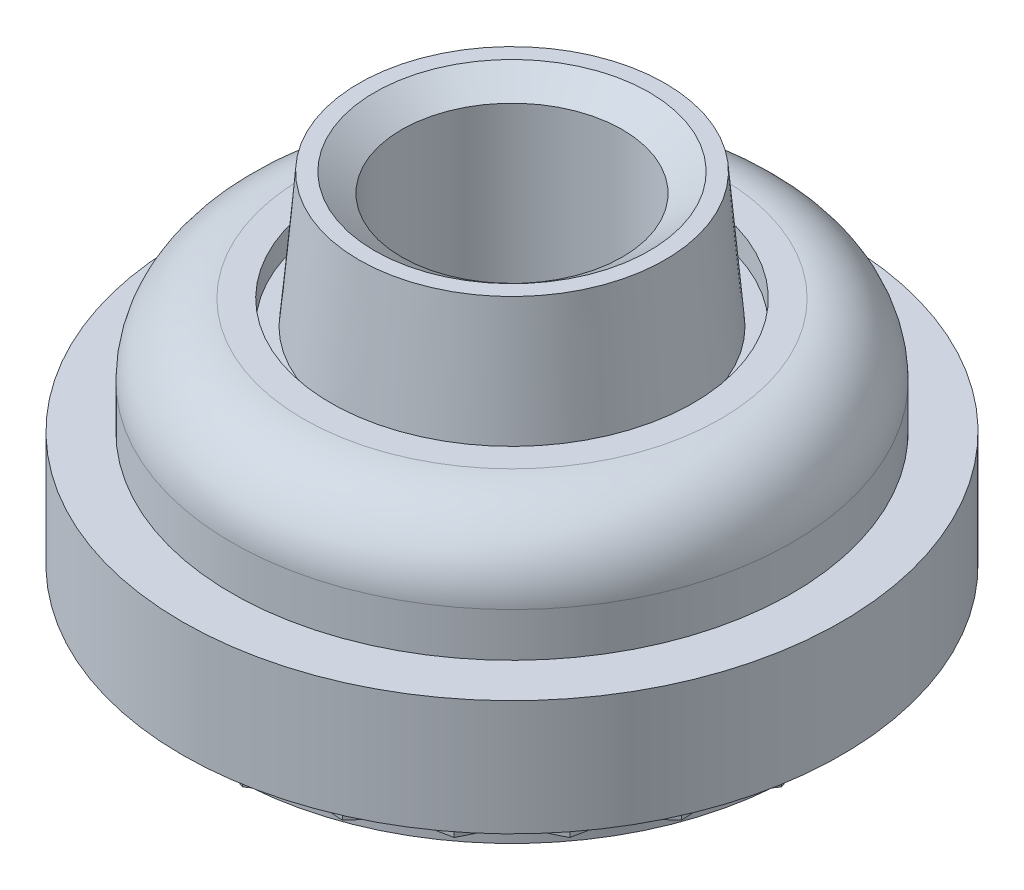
from build123d import *

# Parameters (mm, degrees)
CLINCHINGRINGSEGMENT_DEPTH = 0.38608
CLINCHINGRING_COUNT        = 24
CLINCHINGRING_ANGLE        = 345
SQRCUT_DEPTH               = 0.9652


with BuildPart() as part:
    # BodySke → Body (revolve)
    with BuildSketch(Plane.XY, mode=Mode.PRIVATE) as body_sk:
        with BuildLine():
            Line((6.304896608, 0), (7.62, 0))
            Line((7.62, 0), (7.62, 2.667))
            Line((7.62, 2.667), (6.477, 2.667))
            Line((6.477, 2.667), (6.477, 3.683))
            ThreePointArc((6.477, 3.683), (5.993433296, 4.850433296), (4.826, 5.334))
            Line((4.826, 5.334), (4.191, 5.334))
            Line((4.191, 5.334), (4.191, 4.7752))
            Line((4.191, 4.7752), (3.81, 4.7752))
            Line((3.81, 4.7752), (3.538890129, 7.874))
            Line((3.538890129, 7.874), (2.5527, 7.874))
            Line((2.5527, 7.874), (2.5527, -0.9652))
            Line((2.5527, -0.9652), (6.5278, -0.9652))
            Line((6.5278, -0.9652), (6.5278, -0.77216))
            Line((6.5278, -0.77216), (6.304896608, -0.38608))
            Line((6.304896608, -0.38608), (6.304896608, 0))
        make_face()
    revolve(body_sk.sketch.rotate(Axis((0, 0, 0), (0, 1, 0)), 90), axis=Axis((0, 0, 0), (0, 1, 0)))

    # EndChamferSke → EndChamfer (revolve, cut)
    with BuildSketch(Plane.XY, mode=Mode.PRIVATE) as endchamfer_sk:
        Polygon((3.175, -1.2192), (3.175, -0.96266), (2.5527, -0.527082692), (2.5527, -1.2192), align=None)
        Polygon((3.175, 7.874), (2.5527, 7.438422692), (2.5527, 7.874), align=None)
    revolve(endchamfer_sk.sketch.rotate(Axis((0, -2.54, 0), (0, 1, 0)), 90), axis=Axis((0, -2.54, 0), (0, 1, 0)), mode=Mode.SUBTRACT)

    # CliRinSegSke → ClinchingRingSegment (add)
    with BuildSketch(Plane.XZ):
        Polygon((0.944879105, 7.177069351), (0, 6.858), (-0.944879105, 7.177069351), (-0.916532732, 6.961757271), (0, 6.65226), (0.916532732, 6.961757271), align=None)
    clinchingringsegment = extrude(amount=CLINCHINGRINGSEGMENT_DEPTH)

    # ClinchingRing: ClinchingRingSegment ×24 about axis
    clinchingring_axis = Axis((0, 0, 0), (0, 1, 0))
    for i in range(1, CLINCHINGRING_COUNT):
        add(clinchingringsegment.rotate(clinchingring_axis, i * CLINCHINGRING_ANGLE / (CLINCHINGRING_COUNT - 1)))

    # SqrCutSke → SqrCut (cut)
    with BuildSketch(Plane.XZ.offset(0.9652)):
        with BuildLine():
            Line((-3.556, -4.191), (3.556, -4.191))
            ThreePointArc((3.556, -4.191), (4.005012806, -4.005012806), (4.191, -3.556))
            Line((4.191, -3.556), (4.191, 3.556))
            ThreePointArc((4.191, 3.556), (4.005012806, 4.005012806), (3.556, 4.191))
            Line((3.556, 4.191), (-3.556, 4.191))
            ThreePointArc((-3.556, 4.191), (-4.005012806, 4.005012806), (-4.191, 3.556))
            Line((-4.191, 3.556), (-4.191, -3.556))
            ThreePointArc((-4.191, -3.556), (-4.005012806, -4.005012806), (-3.556, -4.191))
        make_face()
        with BuildLine():
            Line((3.81, -3.556), (3.81, 3.556))
            ThreePointArc((3.81, 3.556), (3.735605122, 3.735605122), (3.556, 3.81))
            Line((3.556, 3.81), (-3.556, 3.81))
            ThreePointArc((-3.556, 3.81), (-3.735605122, 3.735605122), (-3.81, 3.556))
            Line((-3.81, 3.556), (-3.81, -3.556))
            ThreePointArc((-3.81, -3.556), (-3.735605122, -3.735605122), (-3.556, -3.81))
            Line((-3.556, -3.81), (3.556, -3.81))
            ThreePointArc((3.556, -3.81), (3.735605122, -3.735605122), (3.81, -3.556))
        make_face(mode=Mode.SUBTRACT)
    extrude(amount=-SQRCUT_DEPTH, mode=Mode.SUBTRACT)


solid = part.part
